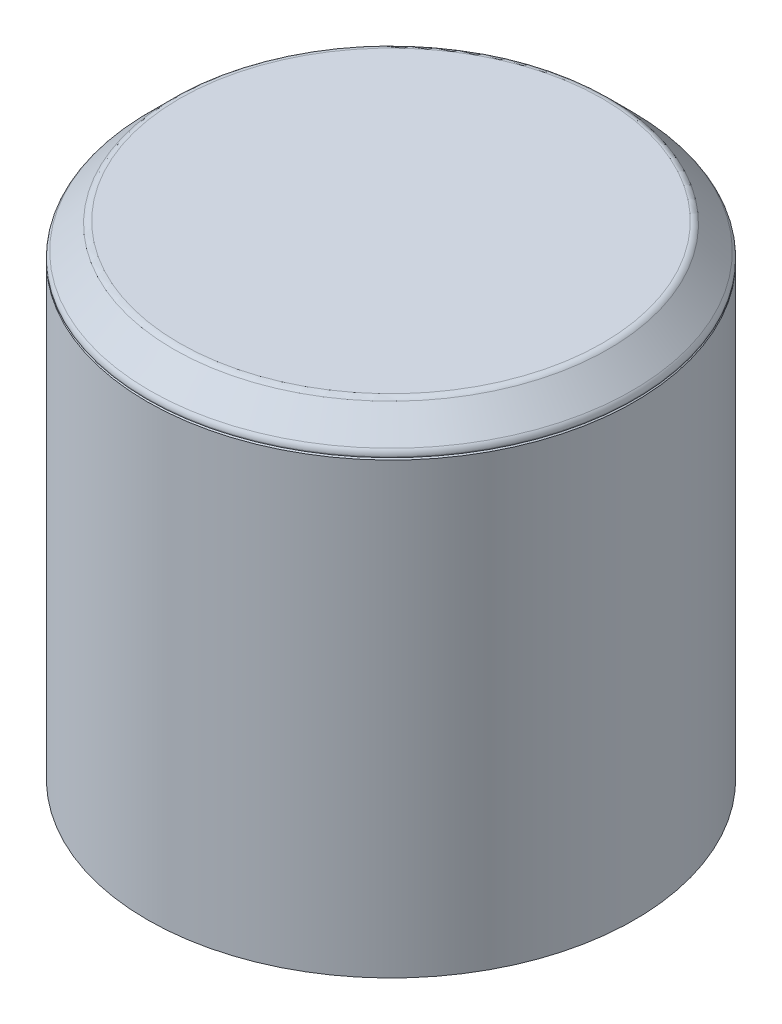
ISO-10303-21;
HEADER;
FILE_DESCRIPTION(('STEP AP214'),'2;1');
FILE_NAME('part.step','',(''),(''),'','','');
FILE_SCHEMA(('AUTOMOTIVE_DESIGN { 1 0 10303 214 1 1 1 1 }'));
ENDSEC;
DATA;
#1=APPLICATION_CONTEXT('core data for automotive mechanical design processes');
#2=APPLICATION_PROTOCOL_DEFINITION('international standard','automotive_design',2000,#1);
#3=PRODUCT_CONTEXT('',#1,'mechanical');
#4=PRODUCT('Part','Part','',(#3));
#5=PRODUCT_RELATED_PRODUCT_CATEGORY('part','',(#4));
#6=PRODUCT_DEFINITION_FORMATION('','',#4);
#7=PRODUCT_DEFINITION_CONTEXT('part definition',#1,'design');
#8=PRODUCT_DEFINITION('design','',#6,#7);
#9=PRODUCT_DEFINITION_SHAPE('','',#8);
#10=(LENGTH_UNIT() NAMED_UNIT(*) SI_UNIT(.MILLI.,.METRE.));
#11=(NAMED_UNIT(*) PLANE_ANGLE_UNIT() SI_UNIT($,.RADIAN.));
#12=(NAMED_UNIT(*) SI_UNIT($,.STERADIAN.) SOLID_ANGLE_UNIT());
#13=UNCERTAINTY_MEASURE_WITH_UNIT(LENGTH_MEASURE(1.E-05),#10,'distance_accuracy_value','');
#14=(GEOMETRIC_REPRESENTATION_CONTEXT(3) GLOBAL_UNCERTAINTY_ASSIGNED_CONTEXT((#13)) GLOBAL_UNIT_ASSIGNED_CONTEXT((#10,
#11,#12)) REPRESENTATION_CONTEXT('',''));
#15=CARTESIAN_POINT('',(0.,0.,0.));
#16=DIRECTION('',(0.,0.,1.));
#17=DIRECTION('',(1.,0.,0.));
#18=AXIS2_PLACEMENT_3D('',#15,#16,#17);
#19=CARTESIAN_POINT('',(0.,118.,0.));
#20=DIRECTION('',(0.,-1.,0.));
#21=DIRECTION('',(0.,0.,-1.));
#22=AXIS2_PLACEMENT_3D('',#19,#20,#21);
#23=CYLINDRICAL_SURFACE('',#22,59.5);
#24=CARTESIAN_POINT('',(0.,110.171572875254,0.));
#25=DIRECTION('',(0.,1.,0.));
#26=DIRECTION('',(0.,0.,1.));
#27=AXIS2_PLACEMENT_3D('',#24,#25,#26);
#28=CIRCLE('',#27,59.5);
#29=CARTESIAN_POINT('',(0.,110.171572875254,59.5));
#30=VERTEX_POINT('',#29);
#31=EDGE_CURVE('E56',#30,#30,#28,.F.);
#32=ORIENTED_EDGE('',*,*,#31,.T.);
#33=EDGE_LOOP('',(#32));
#34=FACE_BOUND('',#33,.T.);
#35=CARTESIAN_POINT('',(0.,110.,0.));
#36=DIRECTION('',(0.,1.,0.));
#37=DIRECTION('',(0.,0.,1.));
#38=AXIS2_PLACEMENT_3D('',#35,#36,#37);
#39=CIRCLE('',#38,59.5);
#40=CARTESIAN_POINT('',(0.,110.,59.5));
#41=VERTEX_POINT('',#40);
#42=EDGE_CURVE('E61',#41,#41,#39,.T.);
#43=ORIENTED_EDGE('',*,*,#42,.T.);
#44=EDGE_LOOP('',(#43));
#45=FACE_BOUND('',#44,.T.);
#46=ADVANCED_FACE('F41',(#34,#45),#23,.T.);
#47=CARTESIAN_POINT('',(0.,118.,0.));
#48=DIRECTION('',(0.,1.,0.));
#49=DIRECTION('',(0.,0.,1.));
#50=AXIS2_PLACEMENT_3D('',#47,#48,#49);
#51=PLANE('',#50);
#52=CARTESIAN_POINT('',(0.,118.,0.));
#53=DIRECTION('',(0.,1.,0.));
#54=DIRECTION('',(0.,0.,1.));
#55=AXIS2_PLACEMENT_3D('',#52,#53,#54);
#56=CIRCLE('',#55,51.6715728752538);
#57=CARTESIAN_POINT('',(0.,118.,51.6715728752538));
#58=VERTEX_POINT('',#57);
#59=EDGE_CURVE('E11',#58,#58,#56,.T.);
#60=ORIENTED_EDGE('',*,*,#59,.T.);
#61=EDGE_LOOP('',(#60));
#62=FACE_BOUND('',#61,.T.);
#63=ADVANCED_FACE('F69',(#62),#51,.T.);
#64=CARTESIAN_POINT('',(0.,110.,0.));
#65=DIRECTION('',(0.,1.,0.));
#66=DIRECTION('',(0.,0.,1.));
#67=AXIS2_PLACEMENT_3D('',#64,#65,#66);
#68=PLANE('',#67);
#69=ORIENTED_EDGE('',*,*,#42,.F.);
#70=EDGE_LOOP('',(#69));
#71=FACE_BOUND('',#70,.T.);
#72=ADVANCED_FACE('F66',(#71),#68,.F.);
#73=CARTESIAN_POINT('',(0.,118.,0.));
#74=DIRECTION('',(0.,-1.,0.));
#75=DIRECTION('',(0.,0.,-1.));
#76=AXIS2_PLACEMENT_3D('',#73,#74,#75);
#77=CONICAL_SURFACE('',#76,52.5,0.785398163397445);
#78=CARTESIAN_POINT('',(0.,111.585786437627,0.));
#79=DIRECTION('',(0.,-1.,0.));
#80=DIRECTION('',(0.,0.,-1.));
#81=AXIS2_PLACEMENT_3D('',#78,#79,#80);
#82=CIRCLE('',#81,58.9142135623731);
#83=CARTESIAN_POINT('',(0.,111.585786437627,-58.9142135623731));
#84=VERTEX_POINT('',#83);
#85=EDGE_CURVE('E48',#84,#84,#82,.F.);
#86=ORIENTED_EDGE('',*,*,#85,.T.);
#87=EDGE_LOOP('',(#86));
#88=FACE_BOUND('',#87,.T.);
#89=CARTESIAN_POINT('',(0.,117.414213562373,0.));
#90=DIRECTION('',(0.,1.,0.));
#91=DIRECTION('',(0.,0.,1.));
#92=AXIS2_PLACEMENT_3D('',#89,#90,#91);
#93=CIRCLE('',#92,53.0857864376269);
#94=CARTESIAN_POINT('',(0.,117.414213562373,53.0857864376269));
#95=VERTEX_POINT('',#94);
#96=EDGE_CURVE('E52',#95,#95,#93,.F.);
#97=ORIENTED_EDGE('',*,*,#96,.T.);
#98=EDGE_LOOP('',(#97));
#99=FACE_BOUND('',#98,.T.);
#100=ADVANCED_FACE('F68',(#88,#99),#77,.T.);
#101=CARTESIAN_POINT('',(0.,110.171572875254,0.));
#102=DIRECTION('',(0.,1.,0.));
#103=DIRECTION('',(0.,0.,1.));
#104=AXIS2_PLACEMENT_3D('',#101,#102,#103);
#105=TOROIDAL_SURFACE('',#104,57.5,2.);
#106=ORIENTED_EDGE('',*,*,#85,.F.);
#107=EDGE_LOOP('',(#106));
#108=FACE_BOUND('',#107,.T.);
#109=ORIENTED_EDGE('',*,*,#31,.F.);
#110=EDGE_LOOP('',(#109));
#111=FACE_BOUND('',#110,.T.);
#112=ADVANCED_FACE('F75',(#108,#111),#105,.T.);
#113=CARTESIAN_POINT('',(0.,116.,0.));
#114=DIRECTION('',(0.,1.,0.));
#115=DIRECTION('',(0.,0.,1.));
#116=AXIS2_PLACEMENT_3D('',#113,#114,#115);
#117=TOROIDAL_SURFACE('',#116,51.6715728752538,2.);
#118=ORIENTED_EDGE('',*,*,#96,.F.);
#119=EDGE_LOOP('',(#118));
#120=FACE_BOUND('',#119,.T.);
#121=ORIENTED_EDGE('',*,*,#59,.F.);
#122=EDGE_LOOP('',(#121));
#123=FACE_BOUND('',#122,.T.);
#124=ADVANCED_FACE('F43',(#120,#123),#117,.T.);
#125=CLOSED_SHELL('',(#46,#63,#72,#100,#112,#124));
#126=MANIFOLD_SOLID_BREP('B2',#125);
#127=CARTESIAN_POINT('',(0.,0.,0.));
#128=DIRECTION('',(0.,-1.,0.));
#129=DIRECTION('',(0.,0.,-1.));
#130=AXIS2_PLACEMENT_3D('',#127,#128,#129);
#131=CYLINDRICAL_SURFACE('',#130,59.5);
#132=CARTESIAN_POINT('',(0.,109.5,0.));
#133=DIRECTION('',(0.,-1.,0.));
#134=DIRECTION('',(0.,0.,-1.));
#135=AXIS2_PLACEMENT_3D('',#132,#133,#134);
#136=CIRCLE('',#135,59.5);
#137=CARTESIAN_POINT('',(0.,109.5,-59.5));
#138=VERTEX_POINT('',#137);
#139=EDGE_CURVE('E134',#138,#138,#136,.T.);
#140=ORIENTED_EDGE('',*,*,#139,.T.);
#141=EDGE_LOOP('',(#140));
#142=FACE_BOUND('',#141,.T.);
#143=CARTESIAN_POINT('',(0.,0.,0.));
#144=DIRECTION('',(0.,-1.,0.));
#145=DIRECTION('',(0.,0.,-1.));
#146=AXIS2_PLACEMENT_3D('',#143,#144,#145);
#147=CIRCLE('',#146,59.5);
#148=CARTESIAN_POINT('',(0.,0.,-59.5));
#149=VERTEX_POINT('',#148);
#150=EDGE_CURVE('E138',#149,#149,#147,.T.);
#151=ORIENTED_EDGE('',*,*,#150,.F.);
#152=EDGE_LOOP('',(#151));
#153=FACE_BOUND('',#152,.T.);
#154=ADVANCED_FACE('F127',(#142,#153),#131,.T.);
#155=CARTESIAN_POINT('',(0.,0.,0.));
#156=DIRECTION('',(0.,-1.,0.));
#157=DIRECTION('',(0.,0.,-1.));
#158=AXIS2_PLACEMENT_3D('',#155,#156,#157);
#159=PLANE('',#158);
#160=ORIENTED_EDGE('',*,*,#150,.T.);
#161=EDGE_LOOP('',(#160));
#162=FACE_BOUND('',#161,.T.);
#163=CARTESIAN_POINT('',(0.,0.,0.));
#164=DIRECTION('',(0.,-1.,0.));
#165=DIRECTION('',(0.,0.,-1.));
#166=AXIS2_PLACEMENT_3D('',#163,#164,#165);
#167=CIRCLE('',#166,45.);
#168=CARTESIAN_POINT('',(0.,0.,-45.));
#169=VERTEX_POINT('',#168);
#170=EDGE_CURVE('E142',#169,#169,#167,.T.);
#171=ORIENTED_EDGE('',*,*,#170,.F.);
#172=EDGE_LOOP('',(#171));
#173=FACE_BOUND('',#172,.T.);
#174=ADVANCED_FACE('F156',(#162,#173),#159,.T.);
#175=CARTESIAN_POINT('',(0.,0.,0.));
#176=DIRECTION('',(0.,-1.,0.));
#177=DIRECTION('',(0.,0.,-1.));
#178=AXIS2_PLACEMENT_3D('',#175,#176,#177);
#179=CYLINDRICAL_SURFACE('',#178,45.);
#180=CARTESIAN_POINT('',(0.,-7.,0.));
#181=DIRECTION('',(0.,-1.,0.));
#182=DIRECTION('',(0.,0.,-1.));
#183=AXIS2_PLACEMENT_3D('',#180,#181,#182);
#184=CIRCLE('',#183,45.);
#185=CARTESIAN_POINT('',(0.,-7.,-45.));
#186=VERTEX_POINT('',#185);
#187=EDGE_CURVE('E147',#186,#186,#184,.T.);
#188=ORIENTED_EDGE('',*,*,#187,.F.);
#189=EDGE_LOOP('',(#188));
#190=FACE_BOUND('',#189,.T.);
#191=ORIENTED_EDGE('',*,*,#170,.T.);
#192=EDGE_LOOP('',(#191));
#193=FACE_BOUND('',#192,.T.);
#194=ADVANCED_FACE('F153',(#190,#193),#179,.T.);
#195=CARTESIAN_POINT('',(0.,-7.,0.));
#196=DIRECTION('',(0.,-1.,0.));
#197=DIRECTION('',(0.,0.,-1.));
#198=AXIS2_PLACEMENT_3D('',#195,#196,#197);
#199=PLANE('',#198);
#200=ORIENTED_EDGE('',*,*,#187,.T.);
#201=EDGE_LOOP('',(#200));
#202=FACE_BOUND('',#201,.T.);
#203=ADVANCED_FACE('F151',(#202),#199,.T.);
#204=CARTESIAN_POINT('',(0.,110.,0.));
#205=DIRECTION('',(0.,-1.,0.));
#206=DIRECTION('',(0.,0.,-1.));
#207=AXIS2_PLACEMENT_3D('',#204,#205,#206);
#208=PLANE('',#207);
#209=CARTESIAN_POINT('',(0.,110.,0.));
#210=DIRECTION('',(0.,-1.,0.));
#211=DIRECTION('',(0.,0.,-1.));
#212=AXIS2_PLACEMENT_3D('',#209,#210,#211);
#213=CIRCLE('',#212,59.);
#214=CARTESIAN_POINT('',(0.,110.,-59.));
#215=VERTEX_POINT('',#214);
#216=EDGE_CURVE('E40',#215,#215,#213,.F.);
#217=ORIENTED_EDGE('',*,*,#216,.T.);
#218=EDGE_LOOP('',(#217));
#219=FACE_BOUND('',#218,.T.);
#220=ADVANCED_FACE('F169',(#219),#208,.F.);
#221=CARTESIAN_POINT('',(0.,109.5,0.));
#222=DIRECTION('',(0.,-1.,0.));
#223=DIRECTION('',(0.,0.,-1.));
#224=AXIS2_PLACEMENT_3D('',#221,#222,#223);
#225=CONICAL_SURFACE('',#224,59.5,0.785398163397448);
#226=ORIENTED_EDGE('',*,*,#216,.F.);
#227=EDGE_LOOP('',(#226));
#228=FACE_BOUND('',#227,.T.);
#229=ORIENTED_EDGE('',*,*,#139,.F.);
#230=EDGE_LOOP('',(#229));
#231=FACE_BOUND('',#230,.T.);
#232=ADVANCED_FACE('F129',(#228,#231),#225,.T.);
#233=CLOSED_SHELL('',(#154,#174,#194,#203,#220,#232));
#234=MANIFOLD_SOLID_BREP('B6',#233);
#235=ADVANCED_BREP_SHAPE_REPRESENTATION('',(#18,#126,#234),#14);
#236=SHAPE_DEFINITION_REPRESENTATION(#9,#235);
ENDSEC;
END-ISO-10303-21;
